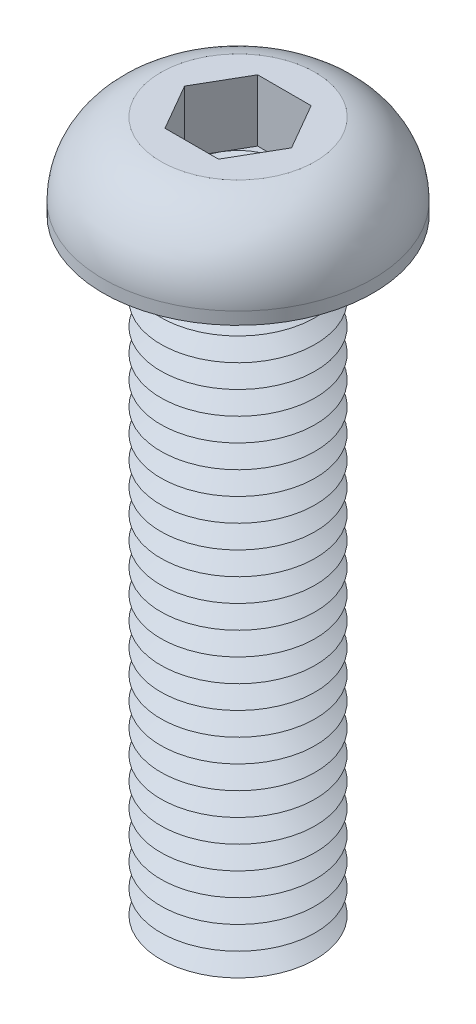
ISO-10303-21;
HEADER;
FILE_DESCRIPTION(('STEP AP214'),'2;1');
FILE_NAME('part.step','',(''),(''),'','','');
FILE_SCHEMA(('AUTOMOTIVE_DESIGN { 1 0 10303 214 1 1 1 1 }'));
ENDSEC;
DATA;
#1=APPLICATION_CONTEXT('core data for automotive mechanical design processes');
#2=APPLICATION_PROTOCOL_DEFINITION('international standard','automotive_design',2000,#1);
#3=PRODUCT_CONTEXT('',#1,'mechanical');
#4=PRODUCT('Part','Part','',(#3));
#5=PRODUCT_RELATED_PRODUCT_CATEGORY('part','',(#4));
#6=PRODUCT_DEFINITION_FORMATION('','',#4);
#7=PRODUCT_DEFINITION_CONTEXT('part definition',#1,'design');
#8=PRODUCT_DEFINITION('design','',#6,#7);
#9=PRODUCT_DEFINITION_SHAPE('','',#8);
#10=(LENGTH_UNIT() NAMED_UNIT(*) SI_UNIT(.MILLI.,.METRE.));
#11=(NAMED_UNIT(*) PLANE_ANGLE_UNIT() SI_UNIT($,.RADIAN.));
#12=(NAMED_UNIT(*) SI_UNIT($,.STERADIAN.) SOLID_ANGLE_UNIT());
#13=UNCERTAINTY_MEASURE_WITH_UNIT(LENGTH_MEASURE(1.E-05),#10,'distance_accuracy_value','');
#14=(GEOMETRIC_REPRESENTATION_CONTEXT(3) GLOBAL_UNCERTAINTY_ASSIGNED_CONTEXT((#13)) GLOBAL_UNIT_ASSIGNED_CONTEXT((#10,
#11,#12)) REPRESENTATION_CONTEXT('',''));
#15=CARTESIAN_POINT('',(0.,0.,0.));
#16=DIRECTION('',(0.,0.,1.));
#17=DIRECTION('',(1.,0.,0.));
#18=AXIS2_PLACEMENT_3D('',#15,#16,#17);
#19=CARTESIAN_POINT('',(0.,0.,0.));
#20=DIRECTION('',(0.,-1.,0.));
#21=DIRECTION('',(0.,0.,-1.));
#22=AXIS2_PLACEMENT_3D('',#19,#20,#21);
#23=TOROIDAL_SURFACE('',#22,5.75,0.75);
#24=CARTESIAN_POINT('',(0.,0.,-6.5));
#25=VERTEX_POINT('',#24);
#26=VERTEX_LOOP('',#25);
#27=FACE_BOUND('',#26,.T.);
#28=ADVANCED_FACE('P0_F12',(#27),#23,.T.);
#29=CLOSED_SHELL('',(#28));
#30=MANIFOLD_SOLID_BREP('P0_B1',#29);
#31=CARTESIAN_POINT('',(1.73205080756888,1.5,-3.));
#32=DIRECTION('',(0.,1.,0.));
#33=DIRECTION('',(0.,0.,1.));
#34=AXIS2_PLACEMENT_3D('',#31,#32,#33);
#35=PLANE('',#34);
#36=CARTESIAN_POINT('',(0.,1.5,0.));
#37=DIRECTION('',(0.,1.,0.));
#38=DIRECTION('',(0.,0.,1.));
#39=AXIS2_PLACEMENT_3D('',#36,#37,#38);
#40=CIRCLE('',#39,3.);
#41=CARTESIAN_POINT('',(0.,1.5,3.));
#42=VERTEX_POINT('',#41);
#43=CARTESIAN_POINT('',(2.59807621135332,1.5,1.5));
#44=VERTEX_POINT('',#43);
#45=EDGE_CURVE('P1_E93',#42,#44,#40,.T.);
#46=ORIENTED_EDGE('',*,*,#45,.F.);
#47=DIRECTION('',(1.,0.,0.));
#48=VECTOR('',#47,1.);
#49=CARTESIAN_POINT('',(-1.73205080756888,1.5,3.));
#50=LINE('',#49,#48);
#51=CARTESIAN_POINT('',(1.73205080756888,1.5,3.));
#52=VERTEX_POINT('',#51);
#53=EDGE_CURVE('P1_E116',#42,#52,#50,.T.);
#54=ORIENTED_EDGE('',*,*,#53,.T.);
#55=DIRECTION('',(0.5,0.,-0.866025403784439));
#56=VECTOR('',#55,1.);
#57=CARTESIAN_POINT('',(1.73205080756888,1.5,3.));
#58=LINE('',#57,#56);
#59=EDGE_CURVE('P1_E112',#52,#44,#58,.T.);
#60=ORIENTED_EDGE('',*,*,#59,.T.);
#61=EDGE_LOOP('',(#46,#54,#60));
#62=FACE_BOUND('',#61,.T.);
#63=ADVANCED_FACE('P1_F15',(#62),#35,.T.);
#64=CARTESIAN_POINT('',(0.,1.5,0.));
#65=DIRECTION('',(0.,1.,0.));
#66=DIRECTION('',(0.,0.,1.));
#67=AXIS2_PLACEMENT_3D('',#64,#65,#66);
#68=CIRCLE('',#67,3.);
#69=CARTESIAN_POINT('',(2.59807621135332,1.5,-1.5));
#70=VERTEX_POINT('',#69);
#71=EDGE_CURVE('P1_E10',#44,#70,#68,.T.);
#72=ORIENTED_EDGE('',*,*,#71,.F.);
#73=CARTESIAN_POINT('',(3.46410161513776,1.5,0.));
#74=VERTEX_POINT('',#73);
#75=EDGE_CURVE('P1_E104',#44,#74,#58,.T.);
#76=ORIENTED_EDGE('',*,*,#75,.T.);
#77=DIRECTION('',(-0.5,0.,-0.866025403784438));
#78=VECTOR('',#77,1.);
#79=CARTESIAN_POINT('',(3.46410161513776,1.5,0.));
#80=LINE('',#79,#78);
#81=EDGE_CURVE('P1_E107',#74,#70,#80,.T.);
#82=ORIENTED_EDGE('',*,*,#81,.T.);
#83=EDGE_LOOP('',(#72,#76,#82));
#84=FACE_BOUND('',#83,.T.);
#85=ADVANCED_FACE('P1_F103',(#84),#35,.T.);
#86=CARTESIAN_POINT('',(0.,1.5,-3.));
#87=VERTEX_POINT('',#86);
#88=EDGE_CURVE('P1_E24',#70,#87,#68,.T.);
#89=ORIENTED_EDGE('',*,*,#88,.F.);
#90=CARTESIAN_POINT('',(1.73205080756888,1.5,-3.));
#91=VERTEX_POINT('',#90);
#92=EDGE_CURVE('P1_E139',#70,#91,#80,.T.);
#93=ORIENTED_EDGE('',*,*,#92,.T.);
#94=DIRECTION('',(-1.,0.,0.));
#95=VECTOR('',#94,1.);
#96=CARTESIAN_POINT('',(1.73205080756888,1.5,-3.));
#97=LINE('',#96,#95);
#98=EDGE_CURVE('P1_E378',#91,#87,#97,.T.);
#99=ORIENTED_EDGE('',*,*,#98,.T.);
#100=EDGE_LOOP('',(#89,#93,#99));
#101=FACE_BOUND('',#100,.T.);
#102=ADVANCED_FACE('P1_F343',(#101),#35,.T.);
#103=CARTESIAN_POINT('',(-2.59807621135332,1.5,-1.5));
#104=VERTEX_POINT('',#103);
#105=EDGE_CURVE('P1_E373',#87,#104,#68,.T.);
#106=ORIENTED_EDGE('',*,*,#105,.F.);
#107=CARTESIAN_POINT('',(-1.73205080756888,1.5,-3.));
#108=VERTEX_POINT('',#107);
#109=EDGE_CURVE('P1_E382',#87,#108,#97,.T.);
#110=ORIENTED_EDGE('',*,*,#109,.T.);
#111=DIRECTION('',(-0.5,0.,0.866025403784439));
#112=VECTOR('',#111,1.);
#113=CARTESIAN_POINT('',(-1.73205080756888,1.5,-3.));
#114=LINE('',#113,#112);
#115=EDGE_CURVE('P1_E377',#108,#104,#114,.T.);
#116=ORIENTED_EDGE('',*,*,#115,.T.);
#117=EDGE_LOOP('',(#106,#110,#116));
#118=FACE_BOUND('',#117,.T.);
#119=ADVANCED_FACE('P1_F357',(#118),#35,.T.);
#120=CARTESIAN_POINT('',(-2.59807621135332,1.5,1.5));
#121=VERTEX_POINT('',#120);
#122=EDGE_CURVE('P1_E31',#104,#121,#68,.T.);
#123=ORIENTED_EDGE('',*,*,#122,.F.);
#124=CARTESIAN_POINT('',(-3.46410161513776,1.5,0.));
#125=VERTEX_POINT('',#124);
#126=EDGE_CURVE('P1_E369',#104,#125,#114,.T.);
#127=ORIENTED_EDGE('',*,*,#126,.T.);
#128=DIRECTION('',(0.5,0.,0.866025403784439));
#129=VECTOR('',#128,1.);
#130=CARTESIAN_POINT('',(-3.46410161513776,1.5,0.));
#131=LINE('',#130,#129);
#132=EDGE_CURVE('P1_E372',#125,#121,#131,.T.);
#133=ORIENTED_EDGE('',*,*,#132,.T.);
#134=EDGE_LOOP('',(#123,#127,#133));
#135=FACE_BOUND('',#134,.T.);
#136=ADVANCED_FACE('P1_F348',(#135),#35,.T.);
#137=CARTESIAN_POINT('',(0.,-38.5,0.));
#138=DIRECTION('',(0.,1.,0.));
#139=DIRECTION('',(0.,0.,1.));
#140=AXIS2_PLACEMENT_3D('',#137,#138,#139);
#141=CONICAL_SURFACE('',#140,3.70096189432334,1.0471975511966);
#142=CARTESIAN_POINT('',(0.,-37.75,0.));
#143=DIRECTION('',(0.,-1.,0.));
#144=DIRECTION('',(0.,0.,-1.));
#145=AXIS2_PLACEMENT_3D('',#142,#143,#144);
#146=CIRCLE('',#145,5.);
#147=CARTESIAN_POINT('',(0.,-37.75,-5.));
#148=VERTEX_POINT('',#147);
#149=EDGE_CURVE('P1_E305',#148,#148,#146,.T.);
#150=ORIENTED_EDGE('',*,*,#149,.T.);
#151=EDGE_LOOP('',(#150));
#152=FACE_BOUND('',#151,.T.);
#153=CARTESIAN_POINT('',(0.,-38.5,0.));
#154=DIRECTION('',(0.,-1.,0.));
#155=DIRECTION('',(0.,0.,-1.));
#156=AXIS2_PLACEMENT_3D('',#153,#154,#155);
#157=CIRCLE('',#156,3.70096189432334);
#158=CARTESIAN_POINT('',(0.,-38.5,-3.70096189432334));
#159=VERTEX_POINT('',#158);
#160=EDGE_CURVE('P1_E308',#159,#159,#157,.T.);
#161=ORIENTED_EDGE('',*,*,#160,.F.);
#162=EDGE_LOOP('',(#161));
#163=FACE_BOUND('',#162,.T.);
#164=ADVANCED_FACE('P1_F356',(#152,#163),#141,.T.);
#165=CARTESIAN_POINT('',(0.,-39.25,0.));
#166=DIRECTION('',(0.,-1.,0.));
#167=DIRECTION('',(0.,0.,-1.));
#168=AXIS2_PLACEMENT_3D('',#165,#166,#167);
#169=CONICAL_SURFACE('',#168,5.,1.0471975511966);
#170=ORIENTED_EDGE('',*,*,#160,.T.);
#171=EDGE_LOOP('',(#170));
#172=FACE_BOUND('',#171,.T.);
#173=CARTESIAN_POINT('',(0.,-39.25,0.));
#174=DIRECTION('',(0.,-1.,0.));
#175=DIRECTION('',(0.,0.,-1.));
#176=AXIS2_PLACEMENT_3D('',#173,#174,#175);
#177=CIRCLE('',#176,5.);
#178=CARTESIAN_POINT('',(0.,-39.25,-5.));
#179=VERTEX_POINT('',#178);
#180=EDGE_CURVE('P1_E311',#179,#179,#177,.T.);
#181=ORIENTED_EDGE('',*,*,#180,.F.);
#182=EDGE_LOOP('',(#181));
#183=FACE_BOUND('',#182,.T.);
#184=ADVANCED_FACE('P1_F363',(#172,#183),#169,.T.);
#185=CARTESIAN_POINT('',(0.,-40.,0.));
#186=DIRECTION('',(0.,1.,0.));
#187=DIRECTION('',(0.,0.,1.));
#188=AXIS2_PLACEMENT_3D('',#185,#186,#187);
#189=PLANE('',#188);
#190=CARTESIAN_POINT('',(0.,-40.,0.));
#191=DIRECTION('',(0.,-1.,0.));
#192=DIRECTION('',(0.,0.,-1.));
#193=AXIS2_PLACEMENT_3D('',#190,#191,#192);
#194=CIRCLE('',#193,3.70096189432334);
#195=CARTESIAN_POINT('',(0.,-40.,-3.70096189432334));
#196=VERTEX_POINT('',#195);
#197=EDGE_CURVE('P1_E314',#196,#196,#194,.T.);
#198=ORIENTED_EDGE('',*,*,#197,.T.);
#199=EDGE_LOOP('',(#198));
#200=FACE_BOUND('',#199,.T.);
#201=ADVANCED_FACE('P1_F441',(#200),#189,.F.);
#202=CARTESIAN_POINT('',(0.,-40.,0.));
#203=DIRECTION('',(0.,1.,0.));
#204=DIRECTION('',(0.,0.,1.));
#205=AXIS2_PLACEMENT_3D('',#202,#203,#204);
#206=CONICAL_SURFACE('',#205,3.70096189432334,1.0471975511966);
#207=ORIENTED_EDGE('',*,*,#180,.T.);
#208=EDGE_LOOP('',(#207));
#209=FACE_BOUND('',#208,.T.);
#210=ORIENTED_EDGE('',*,*,#197,.F.);
#211=EDGE_LOOP('',(#210));
#212=FACE_BOUND('',#211,.T.);
#213=ADVANCED_FACE('P1_F452',(#209,#212),#206,.T.);
#214=CARTESIAN_POINT('',(0.,-37.,0.));
#215=DIRECTION('',(0.,1.,0.));
#216=DIRECTION('',(0.,0.,1.));
#217=AXIS2_PLACEMENT_3D('',#214,#215,#216);
#218=CONICAL_SURFACE('',#217,3.70096189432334,1.0471975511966);
#219=CARTESIAN_POINT('',(0.,-36.25,0.));
#220=DIRECTION('',(0.,-1.,0.));
#221=DIRECTION('',(0.,0.,-1.));
#222=AXIS2_PLACEMENT_3D('',#219,#220,#221);
#223=CIRCLE('',#222,5.);
#224=CARTESIAN_POINT('',(0.,-36.25,-5.));
#225=VERTEX_POINT('',#224);
#226=EDGE_CURVE('P1_E299',#225,#225,#223,.T.);
#227=ORIENTED_EDGE('',*,*,#226,.T.);
#228=EDGE_LOOP('',(#227));
#229=FACE_BOUND('',#228,.T.);
#230=CARTESIAN_POINT('',(0.,-37.,0.));
#231=DIRECTION('',(0.,-1.,0.));
#232=DIRECTION('',(0.,0.,-1.));
#233=AXIS2_PLACEMENT_3D('',#230,#231,#232);
#234=CIRCLE('',#233,3.70096189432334);
#235=CARTESIAN_POINT('',(0.,-37.,-3.70096189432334));
#236=VERTEX_POINT('',#235);
#237=EDGE_CURVE('P1_E302',#236,#236,#234,.T.);
#238=ORIENTED_EDGE('',*,*,#237,.F.);
#239=EDGE_LOOP('',(#238));
#240=FACE_BOUND('',#239,.T.);
#241=ADVANCED_FACE('P1_F461',(#229,#240),#218,.T.);
#242=CARTESIAN_POINT('',(0.,-37.75,0.));
#243=DIRECTION('',(0.,-1.,0.));
#244=DIRECTION('',(0.,0.,-1.));
#245=AXIS2_PLACEMENT_3D('',#242,#243,#244);
#246=CONICAL_SURFACE('',#245,5.,1.0471975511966);
#247=ORIENTED_EDGE('',*,*,#237,.T.);
#248=EDGE_LOOP('',(#247));
#249=FACE_BOUND('',#248,.T.);
#250=ORIENTED_EDGE('',*,*,#149,.F.);
#251=EDGE_LOOP('',(#250));
#252=FACE_BOUND('',#251,.T.);
#253=ADVANCED_FACE('P1_F470',(#249,#252),#246,.T.);
#254=CARTESIAN_POINT('',(0.,-35.5,0.));
#255=DIRECTION('',(0.,1.,0.));
#256=DIRECTION('',(0.,0.,1.));
#257=AXIS2_PLACEMENT_3D('',#254,#255,#256);
#258=CONICAL_SURFACE('',#257,3.70096189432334,1.0471975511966);
#259=CARTESIAN_POINT('',(0.,-34.75,0.));
#260=DIRECTION('',(0.,-1.,0.));
#261=DIRECTION('',(0.,0.,-1.));
#262=AXIS2_PLACEMENT_3D('',#259,#260,#261);
#263=CIRCLE('',#262,5.);
#264=CARTESIAN_POINT('',(0.,-34.75,-5.));
#265=VERTEX_POINT('',#264);
#266=EDGE_CURVE('P1_E293',#265,#265,#263,.T.);
#267=ORIENTED_EDGE('',*,*,#266,.T.);
#268=EDGE_LOOP('',(#267));
#269=FACE_BOUND('',#268,.T.);
#270=CARTESIAN_POINT('',(0.,-35.5,0.));
#271=DIRECTION('',(0.,-1.,0.));
#272=DIRECTION('',(0.,0.,-1.));
#273=AXIS2_PLACEMENT_3D('',#270,#271,#272);
#274=CIRCLE('',#273,3.70096189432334);
#275=CARTESIAN_POINT('',(0.,-35.5,-3.70096189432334));
#276=VERTEX_POINT('',#275);
#277=EDGE_CURVE('P1_E296',#276,#276,#274,.T.);
#278=ORIENTED_EDGE('',*,*,#277,.F.);
#279=EDGE_LOOP('',(#278));
#280=FACE_BOUND('',#279,.T.);
#281=ADVANCED_FACE('P1_F480',(#269,#280),#258,.T.);
#282=CARTESIAN_POINT('',(0.,-36.25,0.));
#283=DIRECTION('',(0.,-1.,0.));
#284=DIRECTION('',(0.,0.,-1.));
#285=AXIS2_PLACEMENT_3D('',#282,#283,#284);
#286=CONICAL_SURFACE('',#285,5.,1.0471975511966);
#287=ORIENTED_EDGE('',*,*,#277,.T.);
#288=EDGE_LOOP('',(#287));
#289=FACE_BOUND('',#288,.T.);
#290=ORIENTED_EDGE('',*,*,#226,.F.);
#291=EDGE_LOOP('',(#290));
#292=FACE_BOUND('',#291,.T.);
#293=ADVANCED_FACE('P1_F490',(#289,#292),#286,.T.);
#294=CARTESIAN_POINT('',(0.,-34.,0.));
#295=DIRECTION('',(0.,1.,0.));
#296=DIRECTION('',(0.,0.,1.));
#297=AXIS2_PLACEMENT_3D('',#294,#295,#296);
#298=CONICAL_SURFACE('',#297,3.70096189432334,1.0471975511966);
#299=CARTESIAN_POINT('',(0.,-33.25,0.));
#300=DIRECTION('',(0.,-1.,0.));
#301=DIRECTION('',(0.,0.,-1.));
#302=AXIS2_PLACEMENT_3D('',#299,#300,#301);
#303=CIRCLE('',#302,5.);
#304=CARTESIAN_POINT('',(0.,-33.25,-5.));
#305=VERTEX_POINT('',#304);
#306=EDGE_CURVE('P1_E287',#305,#305,#303,.T.);
#307=ORIENTED_EDGE('',*,*,#306,.T.);
#308=EDGE_LOOP('',(#307));
#309=FACE_BOUND('',#308,.T.);
#310=CARTESIAN_POINT('',(0.,-34.,0.));
#311=DIRECTION('',(0.,-1.,0.));
#312=DIRECTION('',(0.,0.,-1.));
#313=AXIS2_PLACEMENT_3D('',#310,#311,#312);
#314=CIRCLE('',#313,3.70096189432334);
#315=CARTESIAN_POINT('',(0.,-34.,-3.70096189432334));
#316=VERTEX_POINT('',#315);
#317=EDGE_CURVE('P1_E290',#316,#316,#314,.T.);
#318=ORIENTED_EDGE('',*,*,#317,.F.);
#319=EDGE_LOOP('',(#318));
#320=FACE_BOUND('',#319,.T.);
#321=ADVANCED_FACE('P1_F500',(#309,#320),#298,.T.);
#322=CARTESIAN_POINT('',(0.,-34.75,0.));
#323=DIRECTION('',(0.,-1.,0.));
#324=DIRECTION('',(0.,0.,-1.));
#325=AXIS2_PLACEMENT_3D('',#322,#323,#324);
#326=CONICAL_SURFACE('',#325,5.,1.0471975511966);
#327=ORIENTED_EDGE('',*,*,#317,.T.);
#328=EDGE_LOOP('',(#327));
#329=FACE_BOUND('',#328,.T.);
#330=ORIENTED_EDGE('',*,*,#266,.F.);
#331=EDGE_LOOP('',(#330));
#332=FACE_BOUND('',#331,.T.);
#333=ADVANCED_FACE('P1_F510',(#329,#332),#326,.T.);
#334=CARTESIAN_POINT('',(0.,-32.5,0.));
#335=DIRECTION('',(0.,1.,0.));
#336=DIRECTION('',(0.,0.,1.));
#337=AXIS2_PLACEMENT_3D('',#334,#335,#336);
#338=CONICAL_SURFACE('',#337,3.70096189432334,1.0471975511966);
#339=CARTESIAN_POINT('',(0.,-31.75,0.));
#340=DIRECTION('',(0.,-1.,0.));
#341=DIRECTION('',(0.,0.,-1.));
#342=AXIS2_PLACEMENT_3D('',#339,#340,#341);
#343=CIRCLE('',#342,5.);
#344=CARTESIAN_POINT('',(0.,-31.75,-5.));
#345=VERTEX_POINT('',#344);
#346=EDGE_CURVE('P1_E281',#345,#345,#343,.T.);
#347=ORIENTED_EDGE('',*,*,#346,.T.);
#348=EDGE_LOOP('',(#347));
#349=FACE_BOUND('',#348,.T.);
#350=CARTESIAN_POINT('',(0.,-32.5,0.));
#351=DIRECTION('',(0.,-1.,0.));
#352=DIRECTION('',(0.,0.,-1.));
#353=AXIS2_PLACEMENT_3D('',#350,#351,#352);
#354=CIRCLE('',#353,3.70096189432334);
#355=CARTESIAN_POINT('',(0.,-32.5,-3.70096189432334));
#356=VERTEX_POINT('',#355);
#357=EDGE_CURVE('P1_E284',#356,#356,#354,.T.);
#358=ORIENTED_EDGE('',*,*,#357,.F.);
#359=EDGE_LOOP('',(#358));
#360=FACE_BOUND('',#359,.T.);
#361=ADVANCED_FACE('P1_F520',(#349,#360),#338,.T.);
#362=CARTESIAN_POINT('',(0.,-33.25,0.));
#363=DIRECTION('',(0.,-1.,0.));
#364=DIRECTION('',(0.,0.,-1.));
#365=AXIS2_PLACEMENT_3D('',#362,#363,#364);
#366=CONICAL_SURFACE('',#365,5.,1.0471975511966);
#367=ORIENTED_EDGE('',*,*,#357,.T.);
#368=EDGE_LOOP('',(#367));
#369=FACE_BOUND('',#368,.T.);
#370=ORIENTED_EDGE('',*,*,#306,.F.);
#371=EDGE_LOOP('',(#370));
#372=FACE_BOUND('',#371,.T.);
#373=ADVANCED_FACE('P1_F530',(#369,#372),#366,.T.);
#374=CARTESIAN_POINT('',(0.,-31.,0.));
#375=DIRECTION('',(0.,1.,0.));
#376=DIRECTION('',(0.,0.,1.));
#377=AXIS2_PLACEMENT_3D('',#374,#375,#376);
#378=CONICAL_SURFACE('',#377,3.70096189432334,1.0471975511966);
#379=CARTESIAN_POINT('',(0.,-30.25,0.));
#380=DIRECTION('',(0.,-1.,0.));
#381=DIRECTION('',(0.,0.,-1.));
#382=AXIS2_PLACEMENT_3D('',#379,#380,#381);
#383=CIRCLE('',#382,5.);
#384=CARTESIAN_POINT('',(0.,-30.25,-5.));
#385=VERTEX_POINT('',#384);
#386=EDGE_CURVE('P1_E275',#385,#385,#383,.T.);
#387=ORIENTED_EDGE('',*,*,#386,.T.);
#388=EDGE_LOOP('',(#387));
#389=FACE_BOUND('',#388,.T.);
#390=CARTESIAN_POINT('',(0.,-31.,0.));
#391=DIRECTION('',(0.,-1.,0.));
#392=DIRECTION('',(0.,0.,-1.));
#393=AXIS2_PLACEMENT_3D('',#390,#391,#392);
#394=CIRCLE('',#393,3.70096189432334);
#395=CARTESIAN_POINT('',(0.,-31.,-3.70096189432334));
#396=VERTEX_POINT('',#395);
#397=EDGE_CURVE('P1_E278',#396,#396,#394,.T.);
#398=ORIENTED_EDGE('',*,*,#397,.F.);
#399=EDGE_LOOP('',(#398));
#400=FACE_BOUND('',#399,.T.);
#401=ADVANCED_FACE('P1_F540',(#389,#400),#378,.T.);
#402=CARTESIAN_POINT('',(0.,-31.75,0.));
#403=DIRECTION('',(0.,-1.,0.));
#404=DIRECTION('',(0.,0.,-1.));
#405=AXIS2_PLACEMENT_3D('',#402,#403,#404);
#406=CONICAL_SURFACE('',#405,5.,1.0471975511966);
#407=ORIENTED_EDGE('',*,*,#397,.T.);
#408=EDGE_LOOP('',(#407));
#409=FACE_BOUND('',#408,.T.);
#410=ORIENTED_EDGE('',*,*,#346,.F.);
#411=EDGE_LOOP('',(#410));
#412=FACE_BOUND('',#411,.T.);
#413=ADVANCED_FACE('P1_F550',(#409,#412),#406,.T.);
#414=CARTESIAN_POINT('',(0.,-29.5,0.));
#415=DIRECTION('',(0.,1.,0.));
#416=DIRECTION('',(0.,0.,1.));
#417=AXIS2_PLACEMENT_3D('',#414,#415,#416);
#418=CONICAL_SURFACE('',#417,3.70096189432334,1.0471975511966);
#419=CARTESIAN_POINT('',(0.,-28.75,0.));
#420=DIRECTION('',(0.,-1.,0.));
#421=DIRECTION('',(0.,0.,-1.));
#422=AXIS2_PLACEMENT_3D('',#419,#420,#421);
#423=CIRCLE('',#422,5.);
#424=CARTESIAN_POINT('',(0.,-28.75,-5.));
#425=VERTEX_POINT('',#424);
#426=EDGE_CURVE('P1_E269',#425,#425,#423,.T.);
#427=ORIENTED_EDGE('',*,*,#426,.T.);
#428=EDGE_LOOP('',(#427));
#429=FACE_BOUND('',#428,.T.);
#430=CARTESIAN_POINT('',(0.,-29.5,0.));
#431=DIRECTION('',(0.,-1.,0.));
#432=DIRECTION('',(0.,0.,-1.));
#433=AXIS2_PLACEMENT_3D('',#430,#431,#432);
#434=CIRCLE('',#433,3.70096189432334);
#435=CARTESIAN_POINT('',(0.,-29.5,-3.70096189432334));
#436=VERTEX_POINT('',#435);
#437=EDGE_CURVE('P1_E272',#436,#436,#434,.T.);
#438=ORIENTED_EDGE('',*,*,#437,.F.);
#439=EDGE_LOOP('',(#438));
#440=FACE_BOUND('',#439,.T.);
#441=ADVANCED_FACE('P1_F560',(#429,#440),#418,.T.);
#442=CARTESIAN_POINT('',(0.,-30.25,0.));
#443=DIRECTION('',(0.,-1.,0.));
#444=DIRECTION('',(0.,0.,-1.));
#445=AXIS2_PLACEMENT_3D('',#442,#443,#444);
#446=CONICAL_SURFACE('',#445,5.,1.0471975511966);
#447=ORIENTED_EDGE('',*,*,#437,.T.);
#448=EDGE_LOOP('',(#447));
#449=FACE_BOUND('',#448,.T.);
#450=ORIENTED_EDGE('',*,*,#386,.F.);
#451=EDGE_LOOP('',(#450));
#452=FACE_BOUND('',#451,.T.);
#453=ADVANCED_FACE('P1_F570',(#449,#452),#446,.T.);
#454=CARTESIAN_POINT('',(0.,-28.,0.));
#455=DIRECTION('',(0.,1.,0.));
#456=DIRECTION('',(0.,0.,1.));
#457=AXIS2_PLACEMENT_3D('',#454,#455,#456);
#458=CONICAL_SURFACE('',#457,3.70096189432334,1.0471975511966);
#459=CARTESIAN_POINT('',(0.,-27.25,0.));
#460=DIRECTION('',(0.,-1.,0.));
#461=DIRECTION('',(0.,0.,-1.));
#462=AXIS2_PLACEMENT_3D('',#459,#460,#461);
#463=CIRCLE('',#462,5.);
#464=CARTESIAN_POINT('',(0.,-27.25,-5.));
#465=VERTEX_POINT('',#464);
#466=EDGE_CURVE('P1_E263',#465,#465,#463,.T.);
#467=ORIENTED_EDGE('',*,*,#466,.T.);
#468=EDGE_LOOP('',(#467));
#469=FACE_BOUND('',#468,.T.);
#470=CARTESIAN_POINT('',(0.,-28.,0.));
#471=DIRECTION('',(0.,-1.,0.));
#472=DIRECTION('',(0.,0.,-1.));
#473=AXIS2_PLACEMENT_3D('',#470,#471,#472);
#474=CIRCLE('',#473,3.70096189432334);
#475=CARTESIAN_POINT('',(0.,-28.,-3.70096189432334));
#476=VERTEX_POINT('',#475);
#477=EDGE_CURVE('P1_E266',#476,#476,#474,.T.);
#478=ORIENTED_EDGE('',*,*,#477,.F.);
#479=EDGE_LOOP('',(#478));
#480=FACE_BOUND('',#479,.T.);
#481=ADVANCED_FACE('P1_F580',(#469,#480),#458,.T.);
#482=CARTESIAN_POINT('',(0.,-28.75,0.));
#483=DIRECTION('',(0.,-1.,0.));
#484=DIRECTION('',(0.,0.,-1.));
#485=AXIS2_PLACEMENT_3D('',#482,#483,#484);
#486=CONICAL_SURFACE('',#485,5.,1.0471975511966);
#487=ORIENTED_EDGE('',*,*,#477,.T.);
#488=EDGE_LOOP('',(#487));
#489=FACE_BOUND('',#488,.T.);
#490=ORIENTED_EDGE('',*,*,#426,.F.);
#491=EDGE_LOOP('',(#490));
#492=FACE_BOUND('',#491,.T.);
#493=ADVANCED_FACE('P1_F590',(#489,#492),#486,.T.);
#494=CARTESIAN_POINT('',(0.,-26.5,0.));
#495=DIRECTION('',(0.,1.,0.));
#496=DIRECTION('',(0.,0.,1.));
#497=AXIS2_PLACEMENT_3D('',#494,#495,#496);
#498=CONICAL_SURFACE('',#497,3.70096189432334,1.0471975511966);
#499=CARTESIAN_POINT('',(0.,-25.75,0.));
#500=DIRECTION('',(0.,-1.,0.));
#501=DIRECTION('',(0.,0.,-1.));
#502=AXIS2_PLACEMENT_3D('',#499,#500,#501);
#503=CIRCLE('',#502,5.);
#504=CARTESIAN_POINT('',(0.,-25.75,-5.));
#505=VERTEX_POINT('',#504);
#506=EDGE_CURVE('P1_E257',#505,#505,#503,.T.);
#507=ORIENTED_EDGE('',*,*,#506,.T.);
#508=EDGE_LOOP('',(#507));
#509=FACE_BOUND('',#508,.T.);
#510=CARTESIAN_POINT('',(0.,-26.5,0.));
#511=DIRECTION('',(0.,-1.,0.));
#512=DIRECTION('',(0.,0.,-1.));
#513=AXIS2_PLACEMENT_3D('',#510,#511,#512);
#514=CIRCLE('',#513,3.70096189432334);
#515=CARTESIAN_POINT('',(0.,-26.5,-3.70096189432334));
#516=VERTEX_POINT('',#515);
#517=EDGE_CURVE('P1_E260',#516,#516,#514,.T.);
#518=ORIENTED_EDGE('',*,*,#517,.F.);
#519=EDGE_LOOP('',(#518));
#520=FACE_BOUND('',#519,.T.);
#521=ADVANCED_FACE('P1_F600',(#509,#520),#498,.T.);
#522=CARTESIAN_POINT('',(0.,-27.25,0.));
#523=DIRECTION('',(0.,-1.,0.));
#524=DIRECTION('',(0.,0.,-1.));
#525=AXIS2_PLACEMENT_3D('',#522,#523,#524);
#526=CONICAL_SURFACE('',#525,5.,1.0471975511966);
#527=ORIENTED_EDGE('',*,*,#517,.T.);
#528=EDGE_LOOP('',(#527));
#529=FACE_BOUND('',#528,.T.);
#530=ORIENTED_EDGE('',*,*,#466,.F.);
#531=EDGE_LOOP('',(#530));
#532=FACE_BOUND('',#531,.T.);
#533=ADVANCED_FACE('P1_F610',(#529,#532),#526,.T.);
#534=CARTESIAN_POINT('',(0.,-25.,0.));
#535=DIRECTION('',(0.,1.,0.));
#536=DIRECTION('',(0.,0.,1.));
#537=AXIS2_PLACEMENT_3D('',#534,#535,#536);
#538=CONICAL_SURFACE('',#537,3.70096189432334,1.0471975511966);
#539=CARTESIAN_POINT('',(0.,-24.25,0.));
#540=DIRECTION('',(0.,-1.,0.));
#541=DIRECTION('',(0.,0.,-1.));
#542=AXIS2_PLACEMENT_3D('',#539,#540,#541);
#543=CIRCLE('',#542,5.);
#544=CARTESIAN_POINT('',(0.,-24.25,-5.));
#545=VERTEX_POINT('',#544);
#546=EDGE_CURVE('P1_E251',#545,#545,#543,.T.);
#547=ORIENTED_EDGE('',*,*,#546,.T.);
#548=EDGE_LOOP('',(#547));
#549=FACE_BOUND('',#548,.T.);
#550=CARTESIAN_POINT('',(0.,-25.,0.));
#551=DIRECTION('',(0.,-1.,0.));
#552=DIRECTION('',(0.,0.,-1.));
#553=AXIS2_PLACEMENT_3D('',#550,#551,#552);
#554=CIRCLE('',#553,3.70096189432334);
#555=CARTESIAN_POINT('',(0.,-25.,-3.70096189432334));
#556=VERTEX_POINT('',#555);
#557=EDGE_CURVE('P1_E254',#556,#556,#554,.T.);
#558=ORIENTED_EDGE('',*,*,#557,.F.);
#559=EDGE_LOOP('',(#558));
#560=FACE_BOUND('',#559,.T.);
#561=ADVANCED_FACE('P1_F620',(#549,#560),#538,.T.);
#562=CARTESIAN_POINT('',(0.,-25.75,0.));
#563=DIRECTION('',(0.,-1.,0.));
#564=DIRECTION('',(0.,0.,-1.));
#565=AXIS2_PLACEMENT_3D('',#562,#563,#564);
#566=CONICAL_SURFACE('',#565,5.,1.0471975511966);
#567=ORIENTED_EDGE('',*,*,#557,.T.);
#568=EDGE_LOOP('',(#567));
#569=FACE_BOUND('',#568,.T.);
#570=ORIENTED_EDGE('',*,*,#506,.F.);
#571=EDGE_LOOP('',(#570));
#572=FACE_BOUND('',#571,.T.);
#573=ADVANCED_FACE('P1_F630',(#569,#572),#566,.T.);
#574=CARTESIAN_POINT('',(0.,-23.5,0.));
#575=DIRECTION('',(0.,1.,0.));
#576=DIRECTION('',(0.,0.,1.));
#577=AXIS2_PLACEMENT_3D('',#574,#575,#576);
#578=CONICAL_SURFACE('',#577,3.70096189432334,1.0471975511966);
#579=CARTESIAN_POINT('',(0.,-22.75,0.));
#580=DIRECTION('',(0.,-1.,0.));
#581=DIRECTION('',(0.,0.,-1.));
#582=AXIS2_PLACEMENT_3D('',#579,#580,#581);
#583=CIRCLE('',#582,5.);
#584=CARTESIAN_POINT('',(0.,-22.75,-5.));
#585=VERTEX_POINT('',#584);
#586=EDGE_CURVE('P1_E245',#585,#585,#583,.T.);
#587=ORIENTED_EDGE('',*,*,#586,.T.);
#588=EDGE_LOOP('',(#587));
#589=FACE_BOUND('',#588,.T.);
#590=CARTESIAN_POINT('',(0.,-23.5,0.));
#591=DIRECTION('',(0.,-1.,0.));
#592=DIRECTION('',(0.,0.,-1.));
#593=AXIS2_PLACEMENT_3D('',#590,#591,#592);
#594=CIRCLE('',#593,3.70096189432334);
#595=CARTESIAN_POINT('',(0.,-23.5,-3.70096189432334));
#596=VERTEX_POINT('',#595);
#597=EDGE_CURVE('P1_E248',#596,#596,#594,.T.);
#598=ORIENTED_EDGE('',*,*,#597,.F.);
#599=EDGE_LOOP('',(#598));
#600=FACE_BOUND('',#599,.T.);
#601=ADVANCED_FACE('P1_F640',(#589,#600),#578,.T.);
#602=CARTESIAN_POINT('',(0.,-24.25,0.));
#603=DIRECTION('',(0.,-1.,0.));
#604=DIRECTION('',(0.,0.,-1.));
#605=AXIS2_PLACEMENT_3D('',#602,#603,#604);
#606=CONICAL_SURFACE('',#605,5.,1.0471975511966);
#607=ORIENTED_EDGE('',*,*,#597,.T.);
#608=EDGE_LOOP('',(#607));
#609=FACE_BOUND('',#608,.T.);
#610=ORIENTED_EDGE('',*,*,#546,.F.);
#611=EDGE_LOOP('',(#610));
#612=FACE_BOUND('',#611,.T.);
#613=ADVANCED_FACE('P1_F650',(#609,#612),#606,.T.);
#614=CARTESIAN_POINT('',(0.,-22.,0.));
#615=DIRECTION('',(0.,1.,0.));
#616=DIRECTION('',(0.,0.,1.));
#617=AXIS2_PLACEMENT_3D('',#614,#615,#616);
#618=CONICAL_SURFACE('',#617,3.70096189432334,1.0471975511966);
#619=CARTESIAN_POINT('',(0.,-21.25,0.));
#620=DIRECTION('',(0.,-1.,0.));
#621=DIRECTION('',(0.,0.,-1.));
#622=AXIS2_PLACEMENT_3D('',#619,#620,#621);
#623=CIRCLE('',#622,5.);
#624=CARTESIAN_POINT('',(0.,-21.25,-5.));
#625=VERTEX_POINT('',#624);
#626=EDGE_CURVE('P1_E239',#625,#625,#623,.T.);
#627=ORIENTED_EDGE('',*,*,#626,.T.);
#628=EDGE_LOOP('',(#627));
#629=FACE_BOUND('',#628,.T.);
#630=CARTESIAN_POINT('',(0.,-22.,0.));
#631=DIRECTION('',(0.,-1.,0.));
#632=DIRECTION('',(0.,0.,-1.));
#633=AXIS2_PLACEMENT_3D('',#630,#631,#632);
#634=CIRCLE('',#633,3.70096189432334);
#635=CARTESIAN_POINT('',(0.,-22.,-3.70096189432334));
#636=VERTEX_POINT('',#635);
#637=EDGE_CURVE('P1_E242',#636,#636,#634,.T.);
#638=ORIENTED_EDGE('',*,*,#637,.F.);
#639=EDGE_LOOP('',(#638));
#640=FACE_BOUND('',#639,.T.);
#641=ADVANCED_FACE('P1_F660',(#629,#640),#618,.T.);
#642=CARTESIAN_POINT('',(0.,-22.75,0.));
#643=DIRECTION('',(0.,-1.,0.));
#644=DIRECTION('',(0.,0.,-1.));
#645=AXIS2_PLACEMENT_3D('',#642,#643,#644);
#646=CONICAL_SURFACE('',#645,5.,1.0471975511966);
#647=ORIENTED_EDGE('',*,*,#637,.T.);
#648=EDGE_LOOP('',(#647));
#649=FACE_BOUND('',#648,.T.);
#650=ORIENTED_EDGE('',*,*,#586,.F.);
#651=EDGE_LOOP('',(#650));
#652=FACE_BOUND('',#651,.T.);
#653=ADVANCED_FACE('P1_F670',(#649,#652),#646,.T.);
#654=CARTESIAN_POINT('',(0.,-20.5,0.));
#655=DIRECTION('',(0.,1.,0.));
#656=DIRECTION('',(0.,0.,1.));
#657=AXIS2_PLACEMENT_3D('',#654,#655,#656);
#658=CONICAL_SURFACE('',#657,3.70096189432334,1.0471975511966);
#659=CARTESIAN_POINT('',(0.,-19.75,0.));
#660=DIRECTION('',(0.,-1.,0.));
#661=DIRECTION('',(0.,0.,-1.));
#662=AXIS2_PLACEMENT_3D('',#659,#660,#661);
#663=CIRCLE('',#662,5.);
#664=CARTESIAN_POINT('',(0.,-19.75,-5.));
#665=VERTEX_POINT('',#664);
#666=EDGE_CURVE('P1_E233',#665,#665,#663,.T.);
#667=ORIENTED_EDGE('',*,*,#666,.T.);
#668=EDGE_LOOP('',(#667));
#669=FACE_BOUND('',#668,.T.);
#670=CARTESIAN_POINT('',(0.,-20.5,0.));
#671=DIRECTION('',(0.,-1.,0.));
#672=DIRECTION('',(0.,0.,-1.));
#673=AXIS2_PLACEMENT_3D('',#670,#671,#672);
#674=CIRCLE('',#673,3.70096189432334);
#675=CARTESIAN_POINT('',(0.,-20.5,-3.70096189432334));
#676=VERTEX_POINT('',#675);
#677=EDGE_CURVE('P1_E236',#676,#676,#674,.T.);
#678=ORIENTED_EDGE('',*,*,#677,.F.);
#679=EDGE_LOOP('',(#678));
#680=FACE_BOUND('',#679,.T.);
#681=ADVANCED_FACE('P1_F680',(#669,#680),#658,.T.);
#682=CARTESIAN_POINT('',(0.,-21.25,0.));
#683=DIRECTION('',(0.,-1.,0.));
#684=DIRECTION('',(0.,0.,-1.));
#685=AXIS2_PLACEMENT_3D('',#682,#683,#684);
#686=CONICAL_SURFACE('',#685,5.,1.0471975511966);
#687=ORIENTED_EDGE('',*,*,#677,.T.);
#688=EDGE_LOOP('',(#687));
#689=FACE_BOUND('',#688,.T.);
#690=ORIENTED_EDGE('',*,*,#626,.F.);
#691=EDGE_LOOP('',(#690));
#692=FACE_BOUND('',#691,.T.);
#693=ADVANCED_FACE('P1_F690',(#689,#692),#686,.T.);
#694=CARTESIAN_POINT('',(0.,-19.,0.));
#695=DIRECTION('',(0.,1.,0.));
#696=DIRECTION('',(0.,0.,1.));
#697=AXIS2_PLACEMENT_3D('',#694,#695,#696);
#698=CONICAL_SURFACE('',#697,3.70096189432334,1.0471975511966);
#699=CARTESIAN_POINT('',(0.,-18.25,0.));
#700=DIRECTION('',(0.,-1.,0.));
#701=DIRECTION('',(0.,0.,-1.));
#702=AXIS2_PLACEMENT_3D('',#699,#700,#701);
#703=CIRCLE('',#702,5.);
#704=CARTESIAN_POINT('',(0.,-18.25,-5.));
#705=VERTEX_POINT('',#704);
#706=EDGE_CURVE('P1_E227',#705,#705,#703,.T.);
#707=ORIENTED_EDGE('',*,*,#706,.T.);
#708=EDGE_LOOP('',(#707));
#709=FACE_BOUND('',#708,.T.);
#710=CARTESIAN_POINT('',(0.,-19.,0.));
#711=DIRECTION('',(0.,-1.,0.));
#712=DIRECTION('',(0.,0.,-1.));
#713=AXIS2_PLACEMENT_3D('',#710,#711,#712);
#714=CIRCLE('',#713,3.70096189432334);
#715=CARTESIAN_POINT('',(0.,-19.,-3.70096189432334));
#716=VERTEX_POINT('',#715);
#717=EDGE_CURVE('P1_E230',#716,#716,#714,.T.);
#718=ORIENTED_EDGE('',*,*,#717,.F.);
#719=EDGE_LOOP('',(#718));
#720=FACE_BOUND('',#719,.T.);
#721=ADVANCED_FACE('P1_F700',(#709,#720),#698,.T.);
#722=CARTESIAN_POINT('',(0.,-19.75,0.));
#723=DIRECTION('',(0.,-1.,0.));
#724=DIRECTION('',(0.,0.,-1.));
#725=AXIS2_PLACEMENT_3D('',#722,#723,#724);
#726=CONICAL_SURFACE('',#725,5.,1.0471975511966);
#727=ORIENTED_EDGE('',*,*,#717,.T.);
#728=EDGE_LOOP('',(#727));
#729=FACE_BOUND('',#728,.T.);
#730=ORIENTED_EDGE('',*,*,#666,.F.);
#731=EDGE_LOOP('',(#730));
#732=FACE_BOUND('',#731,.T.);
#733=ADVANCED_FACE('P1_F710',(#729,#732),#726,.T.);
#734=CARTESIAN_POINT('',(0.,-17.5,0.));
#735=DIRECTION('',(0.,1.,0.));
#736=DIRECTION('',(0.,0.,1.));
#737=AXIS2_PLACEMENT_3D('',#734,#735,#736);
#738=CONICAL_SURFACE('',#737,3.70096189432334,1.0471975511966);
#739=CARTESIAN_POINT('',(0.,-16.75,0.));
#740=DIRECTION('',(0.,-1.,0.));
#741=DIRECTION('',(0.,0.,-1.));
#742=AXIS2_PLACEMENT_3D('',#739,#740,#741);
#743=CIRCLE('',#742,5.);
#744=CARTESIAN_POINT('',(0.,-16.75,-5.));
#745=VERTEX_POINT('',#744);
#746=EDGE_CURVE('P1_E221',#745,#745,#743,.T.);
#747=ORIENTED_EDGE('',*,*,#746,.T.);
#748=EDGE_LOOP('',(#747));
#749=FACE_BOUND('',#748,.T.);
#750=CARTESIAN_POINT('',(0.,-17.5,0.));
#751=DIRECTION('',(0.,-1.,0.));
#752=DIRECTION('',(0.,0.,-1.));
#753=AXIS2_PLACEMENT_3D('',#750,#751,#752);
#754=CIRCLE('',#753,3.70096189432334);
#755=CARTESIAN_POINT('',(0.,-17.5,-3.70096189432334));
#756=VERTEX_POINT('',#755);
#757=EDGE_CURVE('P1_E224',#756,#756,#754,.T.);
#758=ORIENTED_EDGE('',*,*,#757,.F.);
#759=EDGE_LOOP('',(#758));
#760=FACE_BOUND('',#759,.T.);
#761=ADVANCED_FACE('P1_F720',(#749,#760),#738,.T.);
#762=CARTESIAN_POINT('',(0.,-18.25,0.));
#763=DIRECTION('',(0.,-1.,0.));
#764=DIRECTION('',(0.,0.,-1.));
#765=AXIS2_PLACEMENT_3D('',#762,#763,#764);
#766=CONICAL_SURFACE('',#765,5.,1.0471975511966);
#767=ORIENTED_EDGE('',*,*,#757,.T.);
#768=EDGE_LOOP('',(#767));
#769=FACE_BOUND('',#768,.T.);
#770=ORIENTED_EDGE('',*,*,#706,.F.);
#771=EDGE_LOOP('',(#770));
#772=FACE_BOUND('',#771,.T.);
#773=ADVANCED_FACE('P1_F730',(#769,#772),#766,.T.);
#774=CARTESIAN_POINT('',(0.,-16.,0.));
#775=DIRECTION('',(0.,1.,0.));
#776=DIRECTION('',(0.,0.,1.));
#777=AXIS2_PLACEMENT_3D('',#774,#775,#776);
#778=CONICAL_SURFACE('',#777,3.70096189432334,1.0471975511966);
#779=CARTESIAN_POINT('',(0.,-15.25,0.));
#780=DIRECTION('',(0.,-1.,0.));
#781=DIRECTION('',(0.,0.,-1.));
#782=AXIS2_PLACEMENT_3D('',#779,#780,#781);
#783=CIRCLE('',#782,5.);
#784=CARTESIAN_POINT('',(0.,-15.25,-5.));
#785=VERTEX_POINT('',#784);
#786=EDGE_CURVE('P1_E215',#785,#785,#783,.T.);
#787=ORIENTED_EDGE('',*,*,#786,.T.);
#788=EDGE_LOOP('',(#787));
#789=FACE_BOUND('',#788,.T.);
#790=CARTESIAN_POINT('',(0.,-16.,0.));
#791=DIRECTION('',(0.,-1.,0.));
#792=DIRECTION('',(0.,0.,-1.));
#793=AXIS2_PLACEMENT_3D('',#790,#791,#792);
#794=CIRCLE('',#793,3.70096189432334);
#795=CARTESIAN_POINT('',(0.,-16.,-3.70096189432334));
#796=VERTEX_POINT('',#795);
#797=EDGE_CURVE('P1_E218',#796,#796,#794,.T.);
#798=ORIENTED_EDGE('',*,*,#797,.F.);
#799=EDGE_LOOP('',(#798));
#800=FACE_BOUND('',#799,.T.);
#801=ADVANCED_FACE('P1_F740',(#789,#800),#778,.T.);
#802=CARTESIAN_POINT('',(0.,-16.75,0.));
#803=DIRECTION('',(0.,-1.,0.));
#804=DIRECTION('',(0.,0.,-1.));
#805=AXIS2_PLACEMENT_3D('',#802,#803,#804);
#806=CONICAL_SURFACE('',#805,5.,1.0471975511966);
#807=ORIENTED_EDGE('',*,*,#797,.T.);
#808=EDGE_LOOP('',(#807));
#809=FACE_BOUND('',#808,.T.);
#810=ORIENTED_EDGE('',*,*,#746,.F.);
#811=EDGE_LOOP('',(#810));
#812=FACE_BOUND('',#811,.T.);
#813=ADVANCED_FACE('P1_F750',(#809,#812),#806,.T.);
#814=CARTESIAN_POINT('',(0.,-14.5,0.));
#815=DIRECTION('',(0.,1.,0.));
#816=DIRECTION('',(0.,0.,1.));
#817=AXIS2_PLACEMENT_3D('',#814,#815,#816);
#818=CONICAL_SURFACE('',#817,3.70096189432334,1.0471975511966);
#819=CARTESIAN_POINT('',(0.,-13.75,0.));
#820=DIRECTION('',(0.,-1.,0.));
#821=DIRECTION('',(0.,0.,-1.));
#822=AXIS2_PLACEMENT_3D('',#819,#820,#821);
#823=CIRCLE('',#822,5.);
#824=CARTESIAN_POINT('',(0.,-13.75,-5.));
#825=VERTEX_POINT('',#824);
#826=EDGE_CURVE('P1_E209',#825,#825,#823,.T.);
#827=ORIENTED_EDGE('',*,*,#826,.T.);
#828=EDGE_LOOP('',(#827));
#829=FACE_BOUND('',#828,.T.);
#830=CARTESIAN_POINT('',(0.,-14.5,0.));
#831=DIRECTION('',(0.,-1.,0.));
#832=DIRECTION('',(0.,0.,-1.));
#833=AXIS2_PLACEMENT_3D('',#830,#831,#832);
#834=CIRCLE('',#833,3.70096189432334);
#835=CARTESIAN_POINT('',(0.,-14.5,-3.70096189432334));
#836=VERTEX_POINT('',#835);
#837=EDGE_CURVE('P1_E212',#836,#836,#834,.T.);
#838=ORIENTED_EDGE('',*,*,#837,.F.);
#839=EDGE_LOOP('',(#838));
#840=FACE_BOUND('',#839,.T.);
#841=ADVANCED_FACE('P1_F760',(#829,#840),#818,.T.);
#842=CARTESIAN_POINT('',(0.,-15.25,0.));
#843=DIRECTION('',(0.,-1.,0.));
#844=DIRECTION('',(0.,0.,-1.));
#845=AXIS2_PLACEMENT_3D('',#842,#843,#844);
#846=CONICAL_SURFACE('',#845,5.,1.0471975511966);
#847=ORIENTED_EDGE('',*,*,#837,.T.);
#848=EDGE_LOOP('',(#847));
#849=FACE_BOUND('',#848,.T.);
#850=ORIENTED_EDGE('',*,*,#786,.F.);
#851=EDGE_LOOP('',(#850));
#852=FACE_BOUND('',#851,.T.);
#853=ADVANCED_FACE('P1_F770',(#849,#852),#846,.T.);
#854=CARTESIAN_POINT('',(0.,-13.,0.));
#855=DIRECTION('',(0.,1.,0.));
#856=DIRECTION('',(0.,0.,1.));
#857=AXIS2_PLACEMENT_3D('',#854,#855,#856);
#858=CONICAL_SURFACE('',#857,3.70096189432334,1.0471975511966);
#859=CARTESIAN_POINT('',(0.,-12.25,0.));
#860=DIRECTION('',(0.,-1.,0.));
#861=DIRECTION('',(0.,0.,-1.));
#862=AXIS2_PLACEMENT_3D('',#859,#860,#861);
#863=CIRCLE('',#862,5.);
#864=CARTESIAN_POINT('',(0.,-12.25,-5.));
#865=VERTEX_POINT('',#864);
#866=EDGE_CURVE('P1_E203',#865,#865,#863,.T.);
#867=ORIENTED_EDGE('',*,*,#866,.T.);
#868=EDGE_LOOP('',(#867));
#869=FACE_BOUND('',#868,.T.);
#870=CARTESIAN_POINT('',(0.,-13.,0.));
#871=DIRECTION('',(0.,-1.,0.));
#872=DIRECTION('',(0.,0.,-1.));
#873=AXIS2_PLACEMENT_3D('',#870,#871,#872);
#874=CIRCLE('',#873,3.70096189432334);
#875=CARTESIAN_POINT('',(0.,-13.,-3.70096189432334));
#876=VERTEX_POINT('',#875);
#877=EDGE_CURVE('P1_E206',#876,#876,#874,.T.);
#878=ORIENTED_EDGE('',*,*,#877,.F.);
#879=EDGE_LOOP('',(#878));
#880=FACE_BOUND('',#879,.T.);
#881=ADVANCED_FACE('P1_F780',(#869,#880),#858,.T.);
#882=CARTESIAN_POINT('',(0.,-13.75,0.));
#883=DIRECTION('',(0.,-1.,0.));
#884=DIRECTION('',(0.,0.,-1.));
#885=AXIS2_PLACEMENT_3D('',#882,#883,#884);
#886=CONICAL_SURFACE('',#885,5.,1.0471975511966);
#887=ORIENTED_EDGE('',*,*,#877,.T.);
#888=EDGE_LOOP('',(#887));
#889=FACE_BOUND('',#888,.T.);
#890=ORIENTED_EDGE('',*,*,#826,.F.);
#891=EDGE_LOOP('',(#890));
#892=FACE_BOUND('',#891,.T.);
#893=ADVANCED_FACE('P1_F790',(#889,#892),#886,.T.);
#894=CARTESIAN_POINT('',(0.,-11.5,0.));
#895=DIRECTION('',(0.,1.,0.));
#896=DIRECTION('',(0.,0.,1.));
#897=AXIS2_PLACEMENT_3D('',#894,#895,#896);
#898=CONICAL_SURFACE('',#897,3.70096189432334,1.0471975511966);
#899=CARTESIAN_POINT('',(0.,-10.75,0.));
#900=DIRECTION('',(0.,-1.,0.));
#901=DIRECTION('',(0.,0.,-1.));
#902=AXIS2_PLACEMENT_3D('',#899,#900,#901);
#903=CIRCLE('',#902,5.);
#904=CARTESIAN_POINT('',(0.,-10.75,-5.));
#905=VERTEX_POINT('',#904);
#906=EDGE_CURVE('P1_E197',#905,#905,#903,.T.);
#907=ORIENTED_EDGE('',*,*,#906,.T.);
#908=EDGE_LOOP('',(#907));
#909=FACE_BOUND('',#908,.T.);
#910=CARTESIAN_POINT('',(0.,-11.5,0.));
#911=DIRECTION('',(0.,-1.,0.));
#912=DIRECTION('',(0.,0.,-1.));
#913=AXIS2_PLACEMENT_3D('',#910,#911,#912);
#914=CIRCLE('',#913,3.70096189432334);
#915=CARTESIAN_POINT('',(0.,-11.5,-3.70096189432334));
#916=VERTEX_POINT('',#915);
#917=EDGE_CURVE('P1_E200',#916,#916,#914,.T.);
#918=ORIENTED_EDGE('',*,*,#917,.F.);
#919=EDGE_LOOP('',(#918));
#920=FACE_BOUND('',#919,.T.);
#921=ADVANCED_FACE('P1_F800',(#909,#920),#898,.T.);
#922=CARTESIAN_POINT('',(0.,-12.25,0.));
#923=DIRECTION('',(0.,-1.,0.));
#924=DIRECTION('',(0.,0.,-1.));
#925=AXIS2_PLACEMENT_3D('',#922,#923,#924);
#926=CONICAL_SURFACE('',#925,5.,1.0471975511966);
#927=ORIENTED_EDGE('',*,*,#917,.T.);
#928=EDGE_LOOP('',(#927));
#929=FACE_BOUND('',#928,.T.);
#930=ORIENTED_EDGE('',*,*,#866,.F.);
#931=EDGE_LOOP('',(#930));
#932=FACE_BOUND('',#931,.T.);
#933=ADVANCED_FACE('P1_F810',(#929,#932),#926,.T.);
#934=CARTESIAN_POINT('',(0.,-10.,0.));
#935=DIRECTION('',(0.,1.,0.));
#936=DIRECTION('',(0.,0.,1.));
#937=AXIS2_PLACEMENT_3D('',#934,#935,#936);
#938=CONICAL_SURFACE('',#937,3.70096189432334,1.0471975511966);
#939=CARTESIAN_POINT('',(0.,-9.25,0.));
#940=DIRECTION('',(0.,-1.,0.));
#941=DIRECTION('',(0.,0.,-1.));
#942=AXIS2_PLACEMENT_3D('',#939,#940,#941);
#943=CIRCLE('',#942,5.);
#944=CARTESIAN_POINT('',(0.,-9.25,-5.));
#945=VERTEX_POINT('',#944);
#946=EDGE_CURVE('P1_E191',#945,#945,#943,.T.);
#947=ORIENTED_EDGE('',*,*,#946,.T.);
#948=EDGE_LOOP('',(#947));
#949=FACE_BOUND('',#948,.T.);
#950=CARTESIAN_POINT('',(0.,-10.,0.));
#951=DIRECTION('',(0.,-1.,0.));
#952=DIRECTION('',(0.,0.,-1.));
#953=AXIS2_PLACEMENT_3D('',#950,#951,#952);
#954=CIRCLE('',#953,3.70096189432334);
#955=CARTESIAN_POINT('',(0.,-10.,-3.70096189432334));
#956=VERTEX_POINT('',#955);
#957=EDGE_CURVE('P1_E194',#956,#956,#954,.T.);
#958=ORIENTED_EDGE('',*,*,#957,.F.);
#959=EDGE_LOOP('',(#958));
#960=FACE_BOUND('',#959,.T.);
#961=ADVANCED_FACE('P1_F820',(#949,#960),#938,.T.);
#962=CARTESIAN_POINT('',(0.,-10.75,0.));
#963=DIRECTION('',(0.,-1.,0.));
#964=DIRECTION('',(0.,0.,-1.));
#965=AXIS2_PLACEMENT_3D('',#962,#963,#964);
#966=CONICAL_SURFACE('',#965,5.,1.0471975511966);
#967=ORIENTED_EDGE('',*,*,#957,.T.);
#968=EDGE_LOOP('',(#967));
#969=FACE_BOUND('',#968,.T.);
#970=ORIENTED_EDGE('',*,*,#906,.F.);
#971=EDGE_LOOP('',(#970));
#972=FACE_BOUND('',#971,.T.);
#973=ADVANCED_FACE('P1_F830',(#969,#972),#966,.T.);
#974=CARTESIAN_POINT('',(0.,-8.5,0.));
#975=DIRECTION('',(0.,1.,0.));
#976=DIRECTION('',(0.,0.,1.));
#977=AXIS2_PLACEMENT_3D('',#974,#975,#976);
#978=CONICAL_SURFACE('',#977,3.70096189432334,1.0471975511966);
#979=CARTESIAN_POINT('',(0.,-7.75,0.));
#980=DIRECTION('',(0.,-1.,0.));
#981=DIRECTION('',(0.,0.,-1.));
#982=AXIS2_PLACEMENT_3D('',#979,#980,#981);
#983=CIRCLE('',#982,5.);
#984=CARTESIAN_POINT('',(0.,-7.75,-5.));
#985=VERTEX_POINT('',#984);
#986=EDGE_CURVE('P1_E185',#985,#985,#983,.T.);
#987=ORIENTED_EDGE('',*,*,#986,.T.);
#988=EDGE_LOOP('',(#987));
#989=FACE_BOUND('',#988,.T.);
#990=CARTESIAN_POINT('',(0.,-8.5,0.));
#991=DIRECTION('',(0.,-1.,0.));
#992=DIRECTION('',(0.,0.,-1.));
#993=AXIS2_PLACEMENT_3D('',#990,#991,#992);
#994=CIRCLE('',#993,3.70096189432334);
#995=CARTESIAN_POINT('',(0.,-8.5,-3.70096189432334));
#996=VERTEX_POINT('',#995);
#997=EDGE_CURVE('P1_E188',#996,#996,#994,.T.);
#998=ORIENTED_EDGE('',*,*,#997,.F.);
#999=EDGE_LOOP('',(#998));
#1000=FACE_BOUND('',#999,.T.);
#1001=ADVANCED_FACE('P1_F840',(#989,#1000),#978,.T.);
#1002=CARTESIAN_POINT('',(0.,-9.25,0.));
#1003=DIRECTION('',(0.,-1.,0.));
#1004=DIRECTION('',(0.,0.,-1.));
#1005=AXIS2_PLACEMENT_3D('',#1002,#1003,#1004);
#1006=CONICAL_SURFACE('',#1005,5.,1.0471975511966);
#1007=ORIENTED_EDGE('',*,*,#997,.T.);
#1008=EDGE_LOOP('',(#1007));
#1009=FACE_BOUND('',#1008,.T.);
#1010=ORIENTED_EDGE('',*,*,#946,.F.);
#1011=EDGE_LOOP('',(#1010));
#1012=FACE_BOUND('',#1011,.T.);
#1013=ADVANCED_FACE('P1_F850',(#1009,#1012),#1006,.T.);
#1014=CARTESIAN_POINT('',(0.,-7.,0.));
#1015=DIRECTION('',(0.,1.,0.));
#1016=DIRECTION('',(0.,0.,1.));
#1017=AXIS2_PLACEMENT_3D('',#1014,#1015,#1016);
#1018=CONICAL_SURFACE('',#1017,3.70096189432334,1.0471975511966);
#1019=CARTESIAN_POINT('',(0.,-6.25,0.));
#1020=DIRECTION('',(0.,-1.,0.));
#1021=DIRECTION('',(0.,0.,-1.));
#1022=AXIS2_PLACEMENT_3D('',#1019,#1020,#1021);
#1023=CIRCLE('',#1022,5.);
#1024=CARTESIAN_POINT('',(0.,-6.25,-5.));
#1025=VERTEX_POINT('',#1024);
#1026=EDGE_CURVE('P1_E179',#1025,#1025,#1023,.T.);
#1027=ORIENTED_EDGE('',*,*,#1026,.T.);
#1028=EDGE_LOOP('',(#1027));
#1029=FACE_BOUND('',#1028,.T.);
#1030=CARTESIAN_POINT('',(0.,-7.,0.));
#1031=DIRECTION('',(0.,-1.,0.));
#1032=DIRECTION('',(0.,0.,-1.));
#1033=AXIS2_PLACEMENT_3D('',#1030,#1031,#1032);
#1034=CIRCLE('',#1033,3.70096189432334);
#1035=CARTESIAN_POINT('',(0.,-7.,-3.70096189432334));
#1036=VERTEX_POINT('',#1035);
#1037=EDGE_CURVE('P1_E182',#1036,#1036,#1034,.T.);
#1038=ORIENTED_EDGE('',*,*,#1037,.F.);
#1039=EDGE_LOOP('',(#1038));
#1040=FACE_BOUND('',#1039,.T.);
#1041=ADVANCED_FACE('P1_F860',(#1029,#1040),#1018,.T.);
#1042=CARTESIAN_POINT('',(0.,-7.75,0.));
#1043=DIRECTION('',(0.,-1.,0.));
#1044=DIRECTION('',(0.,0.,-1.));
#1045=AXIS2_PLACEMENT_3D('',#1042,#1043,#1044);
#1046=CONICAL_SURFACE('',#1045,5.,1.0471975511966);
#1047=ORIENTED_EDGE('',*,*,#1037,.T.);
#1048=EDGE_LOOP('',(#1047));
#1049=FACE_BOUND('',#1048,.T.);
#1050=ORIENTED_EDGE('',*,*,#986,.F.);
#1051=EDGE_LOOP('',(#1050));
#1052=FACE_BOUND('',#1051,.T.);
#1053=ADVANCED_FACE('P1_F870',(#1049,#1052),#1046,.T.);
#1054=CARTESIAN_POINT('',(0.,-5.5,0.));
#1055=DIRECTION('',(0.,1.,0.));
#1056=DIRECTION('',(0.,0.,1.));
#1057=AXIS2_PLACEMENT_3D('',#1054,#1055,#1056);
#1058=CONICAL_SURFACE('',#1057,3.70096189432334,1.0471975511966);
#1059=CARTESIAN_POINT('',(0.,-4.75,0.));
#1060=DIRECTION('',(0.,-1.,0.));
#1061=DIRECTION('',(0.,0.,-1.));
#1062=AXIS2_PLACEMENT_3D('',#1059,#1060,#1061);
#1063=CIRCLE('',#1062,5.);
#1064=CARTESIAN_POINT('',(0.,-4.75,-5.));
#1065=VERTEX_POINT('',#1064);
#1066=EDGE_CURVE('P1_E173',#1065,#1065,#1063,.T.);
#1067=ORIENTED_EDGE('',*,*,#1066,.T.);
#1068=EDGE_LOOP('',(#1067));
#1069=FACE_BOUND('',#1068,.T.);
#1070=CARTESIAN_POINT('',(0.,-5.5,0.));
#1071=DIRECTION('',(0.,-1.,0.));
#1072=DIRECTION('',(0.,0.,-1.));
#1073=AXIS2_PLACEMENT_3D('',#1070,#1071,#1072);
#1074=CIRCLE('',#1073,3.70096189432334);
#1075=CARTESIAN_POINT('',(0.,-5.5,-3.70096189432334));
#1076=VERTEX_POINT('',#1075);
#1077=EDGE_CURVE('P1_E176',#1076,#1076,#1074,.T.);
#1078=ORIENTED_EDGE('',*,*,#1077,.F.);
#1079=EDGE_LOOP('',(#1078));
#1080=FACE_BOUND('',#1079,.T.);
#1081=ADVANCED_FACE('P1_F880',(#1069,#1080),#1058,.T.);
#1082=CARTESIAN_POINT('',(0.,-6.25,0.));
#1083=DIRECTION('',(0.,-1.,0.));
#1084=DIRECTION('',(0.,0.,-1.));
#1085=AXIS2_PLACEMENT_3D('',#1082,#1083,#1084);
#1086=CONICAL_SURFACE('',#1085,5.,1.0471975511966);
#1087=ORIENTED_EDGE('',*,*,#1077,.T.);
#1088=EDGE_LOOP('',(#1087));
#1089=FACE_BOUND('',#1088,.T.);
#1090=ORIENTED_EDGE('',*,*,#1026,.F.);
#1091=EDGE_LOOP('',(#1090));
#1092=FACE_BOUND('',#1091,.T.);
#1093=ADVANCED_FACE('P1_F890',(#1089,#1092),#1086,.T.);
#1094=CARTESIAN_POINT('',(0.,-4.,0.));
#1095=DIRECTION('',(0.,1.,0.));
#1096=DIRECTION('',(0.,0.,1.));
#1097=AXIS2_PLACEMENT_3D('',#1094,#1095,#1096);
#1098=CONICAL_SURFACE('',#1097,3.70096189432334,1.0471975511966);
#1099=CARTESIAN_POINT('',(0.,-3.25,0.));
#1100=DIRECTION('',(0.,-1.,0.));
#1101=DIRECTION('',(0.,0.,-1.));
#1102=AXIS2_PLACEMENT_3D('',#1099,#1100,#1101);
#1103=CIRCLE('',#1102,5.);
#1104=CARTESIAN_POINT('',(0.,-3.25,-5.));
#1105=VERTEX_POINT('',#1104);
#1106=EDGE_CURVE('P1_E164',#1105,#1105,#1103,.T.);
#1107=ORIENTED_EDGE('',*,*,#1106,.T.);
#1108=EDGE_LOOP('',(#1107));
#1109=FACE_BOUND('',#1108,.T.);
#1110=CARTESIAN_POINT('',(0.,-4.,0.));
#1111=DIRECTION('',(0.,-1.,0.));
#1112=DIRECTION('',(0.,0.,-1.));
#1113=AXIS2_PLACEMENT_3D('',#1110,#1111,#1112);
#1114=CIRCLE('',#1113,3.70096189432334);
#1115=CARTESIAN_POINT('',(0.,-4.,-3.70096189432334));
#1116=VERTEX_POINT('',#1115);
#1117=EDGE_CURVE('P1_E170',#1116,#1116,#1114,.T.);
#1118=ORIENTED_EDGE('',*,*,#1117,.F.);
#1119=EDGE_LOOP('',(#1118));
#1120=FACE_BOUND('',#1119,.T.);
#1121=ADVANCED_FACE('P1_F900',(#1109,#1120),#1098,.T.);
#1122=CARTESIAN_POINT('',(0.,-4.75,0.));
#1123=DIRECTION('',(0.,-1.,0.));
#1124=DIRECTION('',(0.,0.,-1.));
#1125=AXIS2_PLACEMENT_3D('',#1122,#1123,#1124);
#1126=CONICAL_SURFACE('',#1125,5.,1.0471975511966);
#1127=ORIENTED_EDGE('',*,*,#1117,.T.);
#1128=EDGE_LOOP('',(#1127));
#1129=FACE_BOUND('',#1128,.T.);
#1130=ORIENTED_EDGE('',*,*,#1066,.F.);
#1131=EDGE_LOOP('',(#1130));
#1132=FACE_BOUND('',#1131,.T.);
#1133=ADVANCED_FACE('P1_F910',(#1129,#1132),#1126,.T.);
#1134=CARTESIAN_POINT('',(0.,-2.5,0.));
#1135=DIRECTION('',(0.,1.,0.));
#1136=DIRECTION('',(0.,0.,1.));
#1137=AXIS2_PLACEMENT_3D('',#1134,#1135,#1136);
#1138=CONICAL_SURFACE('',#1137,3.70096189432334,1.0471975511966);
#1139=CARTESIAN_POINT('',(0.,-1.75,0.));
#1140=DIRECTION('',(0.,-1.,0.));
#1141=DIRECTION('',(0.,0.,-1.));
#1142=AXIS2_PLACEMENT_3D('',#1139,#1140,#1141);
#1143=CIRCLE('',#1142,5.);
#1144=CARTESIAN_POINT('',(0.,-1.75,-5.));
#1145=VERTEX_POINT('',#1144);
#1146=EDGE_CURVE('P1_E167',#1145,#1145,#1143,.T.);
#1147=ORIENTED_EDGE('',*,*,#1146,.T.);
#1148=EDGE_LOOP('',(#1147));
#1149=FACE_BOUND('',#1148,.T.);
#1150=CARTESIAN_POINT('',(0.,-2.5,0.));
#1151=DIRECTION('',(0.,-1.,0.));
#1152=DIRECTION('',(0.,0.,-1.));
#1153=AXIS2_PLACEMENT_3D('',#1150,#1151,#1152);
#1154=CIRCLE('',#1153,3.70096189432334);
#1155=CARTESIAN_POINT('',(0.,-2.5,-3.70096189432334));
#1156=VERTEX_POINT('',#1155);
#1157=EDGE_CURVE('P1_E161',#1156,#1156,#1154,.T.);
#1158=ORIENTED_EDGE('',*,*,#1157,.F.);
#1159=EDGE_LOOP('',(#1158));
#1160=FACE_BOUND('',#1159,.T.);
#1161=ADVANCED_FACE('P1_F920',(#1149,#1160),#1138,.T.);
#1162=CARTESIAN_POINT('',(0.,-3.25,0.));
#1163=DIRECTION('',(0.,-1.,0.));
#1164=DIRECTION('',(0.,0.,-1.));
#1165=AXIS2_PLACEMENT_3D('',#1162,#1163,#1164);
#1166=CONICAL_SURFACE('',#1165,5.,1.0471975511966);
#1167=ORIENTED_EDGE('',*,*,#1157,.T.);
#1168=EDGE_LOOP('',(#1167));
#1169=FACE_BOUND('',#1168,.T.);
#1170=ORIENTED_EDGE('',*,*,#1106,.F.);
#1171=EDGE_LOOP('',(#1170));
#1172=FACE_BOUND('',#1171,.T.);
#1173=ADVANCED_FACE('P1_F930',(#1169,#1172),#1166,.T.);
#1174=CARTESIAN_POINT('',(0.,-40.,0.));
#1175=DIRECTION('',(0.,1.,0.));
#1176=DIRECTION('',(0.,0.,1.));
#1177=AXIS2_PLACEMENT_3D('',#1174,#1175,#1176);
#1178=CYLINDRICAL_SURFACE('',#1177,5.);
#1179=CARTESIAN_POINT('',(0.,0.,0.));
#1180=DIRECTION('',(0.,-1.,0.));
#1181=DIRECTION('',(1.,0.,0.));
#1182=AXIS2_PLACEMENT_3D('',#1179,#1180,#1181);
#1183=CIRCLE('',#1182,5.);
#1184=CARTESIAN_POINT('',(5.,0.,0.));
#1185=VERTEX_POINT('',#1184);
#1186=EDGE_CURVE('P1_E141',#1185,#1185,#1183,.F.);
#1187=ORIENTED_EDGE('',*,*,#1186,.F.);
#1188=EDGE_LOOP('',(#1187));
#1189=FACE_BOUND('',#1188,.T.);
#1190=ORIENTED_EDGE('',*,*,#1146,.F.);
#1191=EDGE_LOOP('',(#1190));
#1192=FACE_BOUND('',#1191,.T.);
#1193=ADVANCED_FACE('P1_F17',(#1189,#1192),#1178,.T.);
#1194=CARTESIAN_POINT('',(0.,0.,0.));
#1195=DIRECTION('',(0.,-1.,0.));
#1196=DIRECTION('',(0.,0.,-1.));
#1197=AXIS2_PLACEMENT_3D('',#1194,#1195,#1196);
#1198=TOROIDAL_SURFACE('',#1197,5.75,0.749999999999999);
#1199=ORIENTED_EDGE('',*,*,#1186,.T.);
#1200=EDGE_LOOP('',(#1199));
#1201=FACE_BOUND('',#1200,.T.);
#1202=CARTESIAN_POINT('',(0.,0.,0.));
#1203=DIRECTION('',(0.,1.,0.));
#1204=DIRECTION('',(-1.,0.,0.));
#1205=AXIS2_PLACEMENT_3D('',#1202,#1203,#1204);
#1206=CIRCLE('',#1205,6.5);
#1207=CARTESIAN_POINT('',(-6.5,0.,0.));
#1208=VERTEX_POINT('',#1207);
#1209=EDGE_CURVE('P1_E151',#1208,#1208,#1206,.F.);
#1210=ORIENTED_EDGE('',*,*,#1209,.T.);
#1211=EDGE_LOOP('',(#1210));
#1212=FACE_BOUND('',#1211,.T.);
#1213=ADVANCED_FACE('P1_F319',(#1201,#1212),#1198,.F.);
#1214=CARTESIAN_POINT('',(5.,5.5,0.));
#1215=DIRECTION('',(0.,-1.,0.));
#1216=DIRECTION('',(1.,0.,0.));
#1217=AXIS2_PLACEMENT_3D('',#1214,#1215,#1216);
#1218=PLANE('',#1217);
#1219=DIRECTION('',(-1.,0.,0.));
#1220=VECTOR('',#1219,1.);
#1221=CARTESIAN_POINT('',(1.73205080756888,5.5,-3.));
#1222=LINE('',#1221,#1220);
#1223=CARTESIAN_POINT('',(1.73205080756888,5.5,-3.));
#1224=VERTEX_POINT('',#1223);
#1225=CARTESIAN_POINT('',(-1.73205080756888,5.5,-3.));
#1226=VERTEX_POINT('',#1225);
#1227=EDGE_CURVE('P1_E125',#1224,#1226,#1222,.T.);
#1228=ORIENTED_EDGE('',*,*,#1227,.F.);
#1229=DIRECTION('',(-0.5,0.,-0.866025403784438));
#1230=VECTOR('',#1229,1.);
#1231=CARTESIAN_POINT('',(3.46410161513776,5.5,0.));
#1232=LINE('',#1231,#1230);
#1233=CARTESIAN_POINT('',(3.46410161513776,5.5,0.));
#1234=VERTEX_POINT('',#1233);
#1235=EDGE_CURVE('P1_E39',#1234,#1224,#1232,.T.);
#1236=ORIENTED_EDGE('',*,*,#1235,.F.);
#1237=DIRECTION('',(0.5,0.,-0.866025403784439));
#1238=VECTOR('',#1237,1.);
#1239=CARTESIAN_POINT('',(1.73205080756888,5.5,3.));
#1240=LINE('',#1239,#1238);
#1241=CARTESIAN_POINT('',(1.73205080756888,5.5,3.));
#1242=VERTEX_POINT('',#1241);
#1243=EDGE_CURVE('P1_E137',#1242,#1234,#1240,.T.);
#1244=ORIENTED_EDGE('',*,*,#1243,.F.);
#1245=DIRECTION('',(1.,0.,0.));
#1246=VECTOR('',#1245,1.);
#1247=CARTESIAN_POINT('',(-1.73205080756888,5.5,3.));
#1248=LINE('',#1247,#1246);
#1249=CARTESIAN_POINT('',(-1.73205080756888,5.5,3.));
#1250=VERTEX_POINT('',#1249);
#1251=EDGE_CURVE('P1_E134',#1250,#1242,#1248,.T.);
#1252=ORIENTED_EDGE('',*,*,#1251,.F.);
#1253=DIRECTION('',(0.5,0.,0.866025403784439));
#1254=VECTOR('',#1253,1.);
#1255=CARTESIAN_POINT('',(-3.46410161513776,5.5,0.));
#1256=LINE('',#1255,#1254);
#1257=CARTESIAN_POINT('',(-3.46410161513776,5.5,0.));
#1258=VERTEX_POINT('',#1257);
#1259=EDGE_CURVE('P1_E131',#1258,#1250,#1256,.T.);
#1260=ORIENTED_EDGE('',*,*,#1259,.F.);
#1261=DIRECTION('',(-0.5,0.,0.866025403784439));
#1262=VECTOR('',#1261,1.);
#1263=CARTESIAN_POINT('',(-1.73205080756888,5.5,-3.));
#1264=LINE('',#1263,#1262);
#1265=EDGE_CURVE('P1_E128',#1226,#1258,#1264,.T.);
#1266=ORIENTED_EDGE('',*,*,#1265,.F.);
#1267=EDGE_LOOP('',(#1228,#1236,#1244,#1252,#1260,#1266));
#1268=FACE_BOUND('',#1267,.T.);
#1269=CARTESIAN_POINT('',(0.,5.5,0.));
#1270=DIRECTION('',(0.,1.,0.));
#1271=DIRECTION('',(-1.,0.,0.));
#1272=AXIS2_PLACEMENT_3D('',#1269,#1270,#1271);
#1273=CIRCLE('',#1272,5.);
#1274=CARTESIAN_POINT('',(-5.,5.5,0.));
#1275=VERTEX_POINT('',#1274);
#1276=EDGE_CURVE('P1_E152',#1275,#1275,#1273,.T.);
#1277=ORIENTED_EDGE('',*,*,#1276,.T.);
#1278=EDGE_LOOP('',(#1277));
#1279=FACE_BOUND('',#1278,.T.);
#1280=ADVANCED_FACE('P1_F397',(#1268,#1279),#1218,.F.);
#1281=CARTESIAN_POINT('',(0.,0.8,0.));
#1282=DIRECTION('',(0.,1.,0.));
#1283=DIRECTION('',(-1.,0.,0.));
#1284=AXIS2_PLACEMENT_3D('',#1281,#1282,#1283);
#1285=DEGENERATE_TOROIDAL_SURFACE('',#1284,3.92966666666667,4.82033333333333,.T.);
#1286=ORIENTED_EDGE('',*,*,#1276,.F.);
#1287=EDGE_LOOP('',(#1286));
#1288=FACE_BOUND('',#1287,.T.);
#1289=CARTESIAN_POINT('',(0.,0.799999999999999,0.));
#1290=DIRECTION('',(0.,1.,0.));
#1291=DIRECTION('',(-1.,0.,0.));
#1292=AXIS2_PLACEMENT_3D('',#1289,#1290,#1291);
#1293=CIRCLE('',#1292,8.75);
#1294=CARTESIAN_POINT('',(-8.75,0.799999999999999,0.));
#1295=VERTEX_POINT('',#1294);
#1296=EDGE_CURVE('P1_E155',#1295,#1295,#1293,.T.);
#1297=ORIENTED_EDGE('',*,*,#1296,.T.);
#1298=EDGE_LOOP('',(#1297));
#1299=FACE_BOUND('',#1298,.T.);
#1300=ADVANCED_FACE('P1_F333',(#1288,#1299),#1285,.T.);
#1301=CARTESIAN_POINT('',(0.,5.5,0.));
#1302=DIRECTION('',(0.,1.,0.));
#1303=DIRECTION('',(-1.,0.,0.));
#1304=AXIS2_PLACEMENT_3D('',#1301,#1302,#1303);
#1305=CYLINDRICAL_SURFACE('',#1304,8.75);
#1306=ORIENTED_EDGE('',*,*,#1296,.F.);
#1307=EDGE_LOOP('',(#1306));
#1308=FACE_BOUND('',#1307,.T.);
#1309=CARTESIAN_POINT('',(0.,0.,0.));
#1310=DIRECTION('',(0.,1.,0.));
#1311=DIRECTION('',(-1.,0.,0.));
#1312=AXIS2_PLACEMENT_3D('',#1309,#1310,#1311);
#1313=CIRCLE('',#1312,8.75);
#1314=CARTESIAN_POINT('',(-8.75,0.,0.));
#1315=VERTEX_POINT('',#1314);
#1316=EDGE_CURVE('P1_E158',#1315,#1315,#1313,.T.);
#1317=ORIENTED_EDGE('',*,*,#1316,.T.);
#1318=EDGE_LOOP('',(#1317));
#1319=FACE_BOUND('',#1318,.T.);
#1320=ADVANCED_FACE('P1_F324',(#1308,#1319),#1305,.T.);
#1321=CARTESIAN_POINT('',(0.,0.,0.));
#1322=DIRECTION('',(0.,1.,0.));
#1323=DIRECTION('',(-1.,0.,0.));
#1324=AXIS2_PLACEMENT_3D('',#1321,#1322,#1323);
#1325=PLANE('',#1324);
#1326=ORIENTED_EDGE('',*,*,#1316,.F.);
#1327=EDGE_LOOP('',(#1326));
#1328=FACE_BOUND('',#1327,.T.);
#1329=ORIENTED_EDGE('',*,*,#1209,.F.);
#1330=EDGE_LOOP('',(#1329));
#1331=FACE_BOUND('',#1330,.T.);
#1332=ADVANCED_FACE('P1_F321',(#1328,#1331),#1325,.F.);
#1333=CARTESIAN_POINT('',(3.46410161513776,1.5,0.));
#1334=DIRECTION('',(0.866025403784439,0.,-0.5));
#1335=DIRECTION('',(-0.5,0.,-0.866025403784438));
#1336=AXIS2_PLACEMENT_3D('',#1333,#1334,#1335);
#1337=PLANE('',#1336);
#1338=ORIENTED_EDGE('',*,*,#1235,.T.);
#1339=DIRECTION('',(0.,1.,0.));
#1340=VECTOR('',#1339,1.);
#1341=CARTESIAN_POINT('',(1.73205080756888,1.5,-3.));
#1342=LINE('',#1341,#1340);
#1343=EDGE_CURVE('P1_E118',#91,#1224,#1342,.T.);
#1344=ORIENTED_EDGE('',*,*,#1343,.F.);
#1345=ORIENTED_EDGE('',*,*,#92,.F.);
#1346=ORIENTED_EDGE('',*,*,#81,.F.);
#1347=DIRECTION('',(0.,1.,0.));
#1348=VECTOR('',#1347,1.);
#1349=CARTESIAN_POINT('',(3.46410161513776,1.5,0.));
#1350=LINE('',#1349,#1348);
#1351=EDGE_CURVE('P1_E113',#74,#1234,#1350,.T.);
#1352=ORIENTED_EDGE('',*,*,#1351,.T.);
#1353=EDGE_LOOP('',(#1338,#1344,#1345,#1346,#1352));
#1354=FACE_BOUND('',#1353,.T.);
#1355=ADVANCED_FACE('P1_F323',(#1354),#1337,.F.);
#1356=CARTESIAN_POINT('',(1.73205080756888,1.5,3.));
#1357=DIRECTION('',(0.866025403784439,0.,0.5));
#1358=DIRECTION('',(0.5,0.,-0.866025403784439));
#1359=AXIS2_PLACEMENT_3D('',#1356,#1357,#1358);
#1360=PLANE('',#1359);
#1361=ORIENTED_EDGE('',*,*,#1243,.T.);
#1362=ORIENTED_EDGE('',*,*,#1351,.F.);
#1363=ORIENTED_EDGE('',*,*,#75,.F.);
#1364=ORIENTED_EDGE('',*,*,#59,.F.);
#1365=DIRECTION('',(0.,1.,0.));
#1366=VECTOR('',#1365,1.);
#1367=CARTESIAN_POINT('',(1.73205080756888,1.5,3.));
#1368=LINE('',#1367,#1366);
#1369=EDGE_CURVE('P1_E142',#52,#1242,#1368,.T.);
#1370=ORIENTED_EDGE('',*,*,#1369,.T.);
#1371=EDGE_LOOP('',(#1361,#1362,#1363,#1364,#1370));
#1372=FACE_BOUND('',#1371,.T.);
#1373=ADVANCED_FACE('P1_F111',(#1372),#1360,.F.);
#1374=CARTESIAN_POINT('',(-1.73205080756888,1.5,3.));
#1375=DIRECTION('',(0.,0.,1.));
#1376=DIRECTION('',(1.,0.,0.));
#1377=AXIS2_PLACEMENT_3D('',#1374,#1375,#1376);
#1378=PLANE('',#1377);
#1379=ORIENTED_EDGE('',*,*,#1251,.T.);
#1380=ORIENTED_EDGE('',*,*,#1369,.F.);
#1381=ORIENTED_EDGE('',*,*,#53,.F.);
#1382=CARTESIAN_POINT('',(-1.73205080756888,1.5,3.));
#1383=VERTEX_POINT('',#1382);
#1384=EDGE_CURVE('P1_E114',#1383,#42,#50,.T.);
#1385=ORIENTED_EDGE('',*,*,#1384,.F.);
#1386=DIRECTION('',(0.,1.,0.));
#1387=VECTOR('',#1386,1.);
#1388=CARTESIAN_POINT('',(-1.73205080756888,1.5,3.));
#1389=LINE('',#1388,#1387);
#1390=EDGE_CURVE('P1_E144',#1383,#1250,#1389,.T.);
#1391=ORIENTED_EDGE('',*,*,#1390,.T.);
#1392=EDGE_LOOP('',(#1379,#1380,#1381,#1385,#1391));
#1393=FACE_BOUND('',#1392,.T.);
#1394=ADVANCED_FACE('P1_F392',(#1393),#1378,.F.);
#1395=CARTESIAN_POINT('',(-3.46410161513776,1.5,0.));
#1396=DIRECTION('',(-0.866025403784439,0.,0.5));
#1397=DIRECTION('',(0.5,0.,0.866025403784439));
#1398=AXIS2_PLACEMENT_3D('',#1395,#1396,#1397);
#1399=PLANE('',#1398);
#1400=ORIENTED_EDGE('',*,*,#1259,.T.);
#1401=ORIENTED_EDGE('',*,*,#1390,.F.);
#1402=EDGE_CURVE('P1_E384',#121,#1383,#131,.T.);
#1403=ORIENTED_EDGE('',*,*,#1402,.F.);
#1404=ORIENTED_EDGE('',*,*,#132,.F.);
#1405=DIRECTION('',(0.,1.,0.));
#1406=VECTOR('',#1405,1.);
#1407=CARTESIAN_POINT('',(-3.46410161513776,1.5,0.));
#1408=LINE('',#1407,#1406);
#1409=EDGE_CURVE('P1_E146',#125,#1258,#1408,.T.);
#1410=ORIENTED_EDGE('',*,*,#1409,.T.);
#1411=EDGE_LOOP('',(#1400,#1401,#1403,#1404,#1410));
#1412=FACE_BOUND('',#1411,.T.);
#1413=ADVANCED_FACE('P1_F1008',(#1412),#1399,.F.);
#1414=CARTESIAN_POINT('',(-1.73205080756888,1.5,-3.));
#1415=DIRECTION('',(-0.866025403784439,0.,-0.5));
#1416=DIRECTION('',(-0.5,0.,0.866025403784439));
#1417=AXIS2_PLACEMENT_3D('',#1414,#1415,#1416);
#1418=PLANE('',#1417);
#1419=ORIENTED_EDGE('',*,*,#1265,.T.);
#1420=ORIENTED_EDGE('',*,*,#1409,.F.);
#1421=ORIENTED_EDGE('',*,*,#126,.F.);
#1422=ORIENTED_EDGE('',*,*,#115,.F.);
#1423=DIRECTION('',(0.,1.,0.));
#1424=VECTOR('',#1423,1.);
#1425=CARTESIAN_POINT('',(-1.73205080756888,1.5,-3.));
#1426=LINE('',#1425,#1424);
#1427=EDGE_CURVE('P1_E119',#108,#1226,#1426,.T.);
#1428=ORIENTED_EDGE('',*,*,#1427,.T.);
#1429=EDGE_LOOP('',(#1419,#1420,#1421,#1422,#1428));
#1430=FACE_BOUND('',#1429,.T.);
#1431=ADVANCED_FACE('P1_F352',(#1430),#1418,.F.);
#1432=CARTESIAN_POINT('',(1.73205080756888,1.5,-3.));
#1433=DIRECTION('',(0.,0.,-1.));
#1434=DIRECTION('',(-1.,0.,0.));
#1435=AXIS2_PLACEMENT_3D('',#1432,#1433,#1434);
#1436=PLANE('',#1435);
#1437=ORIENTED_EDGE('',*,*,#1227,.T.);
#1438=ORIENTED_EDGE('',*,*,#1427,.F.);
#1439=ORIENTED_EDGE('',*,*,#109,.F.);
#1440=ORIENTED_EDGE('',*,*,#98,.F.);
#1441=ORIENTED_EDGE('',*,*,#1343,.T.);
#1442=EDGE_LOOP('',(#1437,#1438,#1439,#1440,#1441));
#1443=FACE_BOUND('',#1442,.T.);
#1444=ADVANCED_FACE('P1_F346',(#1443),#1436,.F.);
#1445=EDGE_CURVE('P1_E19',#121,#42,#68,.T.);
#1446=ORIENTED_EDGE('',*,*,#1445,.F.);
#1447=ORIENTED_EDGE('',*,*,#1402,.T.);
#1448=ORIENTED_EDGE('',*,*,#1384,.T.);
#1449=EDGE_LOOP('',(#1446,#1447,#1448));
#1450=FACE_BOUND('',#1449,.T.);
#1451=ADVANCED_FACE('P1_F90',(#1450),#35,.T.);
#1452=CARTESIAN_POINT('',(0.,1.5,0.));
#1453=DIRECTION('',(0.,1.,0.));
#1454=DIRECTION('',(0.,0.,1.));
#1455=AXIS2_PLACEMENT_3D('',#1452,#1453,#1454);
#1456=CONICAL_SURFACE('',#1455,3.,1.0471975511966);
#1457=CARTESIAN_POINT('',(0.,-0.232050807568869,0.));
#1458=VERTEX_POINT('',#1457);
#1459=VERTEX_LOOP('',#1458);
#1460=FACE_BOUND('',#1459,.T.);
#1461=ORIENTED_EDGE('',*,*,#45,.T.);
#1462=ORIENTED_EDGE('',*,*,#71,.T.);
#1463=ORIENTED_EDGE('',*,*,#88,.T.);
#1464=ORIENTED_EDGE('',*,*,#105,.T.);
#1465=ORIENTED_EDGE('',*,*,#122,.T.);
#1466=ORIENTED_EDGE('',*,*,#1445,.T.);
#1467=EDGE_LOOP('',(#1461,#1462,#1463,#1464,#1465,#1466));
#1468=FACE_BOUND('',#1467,.T.);
#1469=ADVANCED_FACE('P1_F88',(#1460,#1468),#1456,.F.);
#1470=CLOSED_SHELL('',(#63,#85,#102,#119,#136,#164,#184,#201,#213,#241,#253,#281,#293,#321,#333,
#361,#373,#401,#413,#441,#453,#481,#493,#521,#533,#561,#573,#601,#613,#641,#653,#681,#693,#721,
#733,#761,#773,#801,#813,#841,#853,#881,#893,#921,#933,#961,#973,#1001,#1013,#1041,#1053,#1081,
#1093,#1121,#1133,#1161,#1173,#1193,#1213,#1280,#1300,#1320,#1332,#1355,#1373,#1394,#1413,#1431,
#1444,#1451,#1469));
#1471=MANIFOLD_SOLID_BREP('P1_B1',#1470);
#1472=ADVANCED_BREP_SHAPE_REPRESENTATION('',(#18,#30,#1471),#14);
#1473=SHAPE_DEFINITION_REPRESENTATION(#9,#1472);
ENDSEC;
END-ISO-10303-21;
